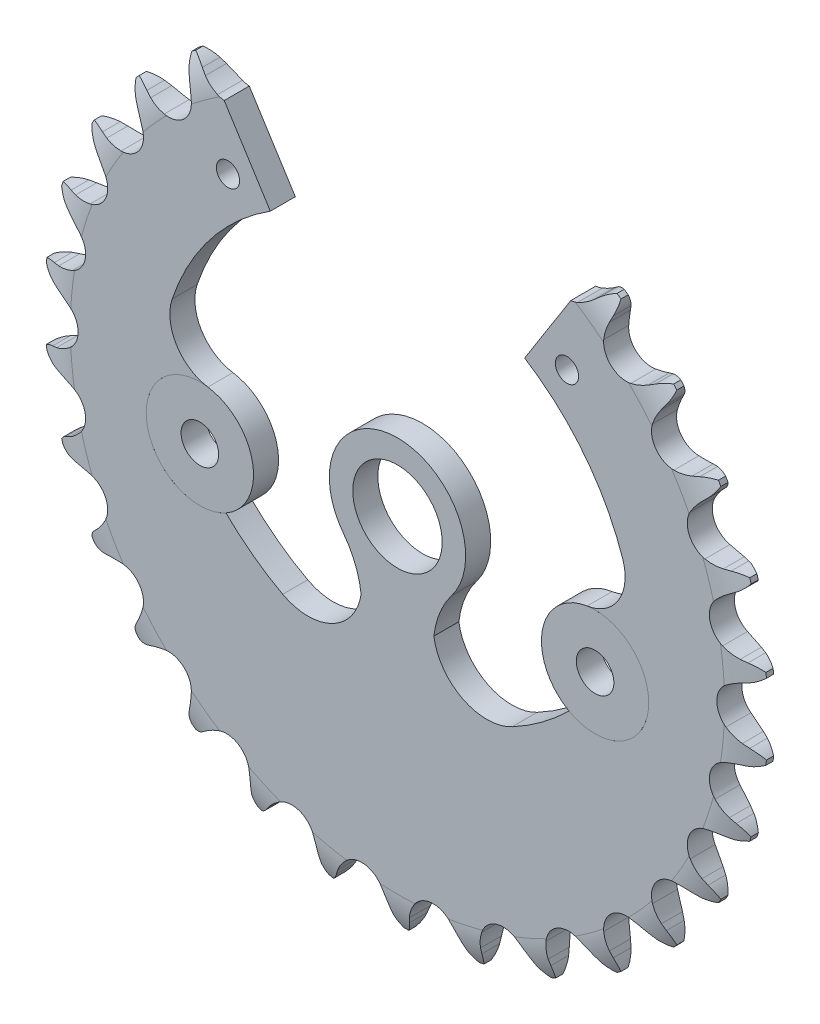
from build123d import *
from build123d.topology import SkipClean

# Parameters (mm, degrees)
CUT_EXTRUDE1_DEPTH      = 58.232611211
CIRPATTERN1_COUNT       = 30
BOSS_EXTRUDE1_START     = 1.4
SKETCH2_R               = 20
BOSS_EXTRUDE1_DEPTH     = 13.2
CUT_EXTRUDE2_DEPTH      = 59.916091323
CUT_EXTRUDE2_DEPTH_BACK = 59.916091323
SKETCH3_R               = 5
SKETCH4_W               = 2.1
SKETCH4_H               = 7.490368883
CUT_EXTRUDE4_START      = -13.2
SKETCH6_R               = 20
CUT_EXTRUDE4_DEPTH      = 13.2
SKETCH8_R               = 6
BOSS_EXTRUDE3_DEPTH     = 0.0001
CUT_EXTRUDE5_DEPTH      = 58.147054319
M5X0_8_TAPPED_HOLE3_D   = 4.2
CUT_EXTRUDE7_DEPTH      = 58.147059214
M2_TAPPED_HOLE1_D       = 2.6


with BuildPart() as part:
    # Sketch1 → Revolve1 (revolve)
    with BuildSketch(Plane(origin=(0, 0, 0), x_dir=(0, 0, -1), z_dir=(1, 0, 0))):
        with BuildLine():
            Line((1.4, 0), (-1.4, 0))
            Line((-1.4, 0), (-1.4, 36.584474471))
            ThreePointArc((-1.4, 36.584474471), (-1.145966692, 38.584474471), (-0.4, 40.457457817))
            Line((-0.4, 40.457457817), (0.4, 40.457457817))
            ThreePointArc((0.4, 40.457457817), (1.145966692, 38.584474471), (1.4, 36.584474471))
            Line((1.4, 36.584474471), (1.4, 0))
        make_face()
    revolve(axis=Axis((0, 0, -1.4), (0, 0, 1)))

    # Sketch0 → Cut-Extrude1 (cut, symmetric)
    with BuildSketch(Plane.XY):
        with BuildLine():
            Line((7.22745346, -38.435746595), (6.918117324, -37.825131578))
            ThreePointArc((6.918117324, -37.825131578), (6.444890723, -37.034427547), (5.865390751, -36.3179528))
            ThreePointArc((5.865390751, -36.3179528), (3.733389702, -35.520830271), (1.813709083, -36.743801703))
            ThreePointArc((1.813709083, -36.743801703), (1.395836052, -37.565104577), (1.0973472, -38.436919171))
            Line((1.0973472, -38.436919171), (0.921724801, -39.098505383))
            ThreePointArc((0.921724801, -39.098505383), (-0.654559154, -41.368441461), (-3.318860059, -42.102458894))
            ThreePointArc((-3.318860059, -42.102458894), (4.414557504, -42.001709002), (11.99992842, -40.492389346))
            ThreePointArc((11.99992842, -40.492389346), (9.241238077, -40.32835126), (7.22745346, -38.435746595))
        make_face()
    cut_extrude1 = extrude(amount=CUT_EXTRUDE1_DEPTH, both=True, mode=Mode.SUBTRACT)

    # CirPattern1: Cut-Extrude1 ×30 about axis
    cirpattern1_axis = Axis((0, 0, 0), (0, 0, 1))
    for i in range(1, CIRPATTERN1_COUNT):
        add(cut_extrude1.rotate(cirpattern1_axis, i * 360 / CIRPATTERN1_COUNT), mode=Mode.SUBTRACT)

    # Sketch2 → Boss-Extrude1 (add)
    with BuildSketch(Plane.XY.offset(BOSS_EXTRUDE1_START)):
        with Locations(Location((0, 0, 0), (0, 0, 180))):
            Circle(SKETCH2_R)
    extrude(amount=BOSS_EXTRUDE1_DEPTH)

    # Sketch3 → Cut-Extrude2 (cut, two sides: drawn at the far end of the back side and taken through both)
    with BuildSketch(Plane.XY.offset(-CUT_EXTRUDE2_DEPTH_BACK)):
        Circle(SKETCH3_R)
    extrude(amount=CUT_EXTRUDE2_DEPTH + CUT_EXTRUDE2_DEPTH_BACK, mode=Mode.SUBTRACT)

    # Sketch4 → Cut-Revolve1 (revolve, cut)
    with BuildSketch(Plane(origin=(0, 0, 0), x_dir=(0, 0, -1), z_dir=(1, 0, 0)), mode=Mode.PRIVATE) as cut_revolve1_sk:
        Polygon((-14.6, 20), (-14.6, 19.5), (-14.1, 20), align=None)
        with Locations((-2.45, 36.712273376)):
            Rectangle(SKETCH4_W, SKETCH4_H)
    revolve(cut_revolve1_sk.sketch.rotate(Axis((0, 0, -1.4), (0, 0, 1)), 90), axis=Axis((0, 0, -1.4), (0, 0, 1)), mode=Mode.SUBTRACT)

    # Sketch6 → Cut-Extrude4 (cut)
    with BuildSketch(Plane.XY.offset(14.6).offset(CUT_EXTRUDE4_START)):
        Circle(SKETCH6_R)
    extrude(amount=CUT_EXTRUDE4_DEPTH, mode=Mode.SUBTRACT)

    # Sketch8 → Boss-Extrude3 (add)
    with BuildSketch(Plane.XY.offset(1.4)):
        with Locations((22.100856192, -4.000469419)):
            Circle(SKETCH8_R)
        with Locations(Location((-22.100856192, -4.000469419, 0), (0, 0, 180))):
            Circle(SKETCH8_R)
    extrude(amount=BOSS_EXTRUDE3_DEPTH)

    # Sketch9 → Cut-Extrude5 (cut, through all)
    with SkipClean():  # the faces are left unmerged after this step: merging them gives an invalid solid
        with BuildSketch(Plane.XY.offset(1.4)):
            with BuildLine():
                ThreePointArc((-12.834023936, -13.949278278), (-7.310717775, -14.02432971), (-4.066768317, -9.553386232))
                ThreePointArc((-4.066768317, -9.553386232), (-4.729241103, -6.958299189), (-6.056737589, -4.63212206))
                ThreePointArc((-6.056737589, -4.63212206), (0, 7.625), (6.056737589, -4.63212206))
                ThreePointArc((6.056737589, -4.63212206), (4.729241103, -6.958299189), (4.066768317, -9.553386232))
                ThreePointArc((4.066768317, -9.553386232), (7.310717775, -14.02432971), (12.834023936, -13.949278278))
                ThreePointArc((12.834023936, -13.949278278), (16.180462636, -11.828255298), (19.182870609, -9.243117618))
                ThreePointArc((19.182870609, -9.243117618), (16.196798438, -2.931777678), (21.205745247, 1.93238625))
                ThreePointArc((21.205745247, 1.93238625), (24.726593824, 4.269780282), (25.199295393, 8.469344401))
                ThreePointArc((25.199295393, 8.469344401), (0, 26.584474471), (-25.199295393, 8.469344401))
                ThreePointArc((-25.199295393, 8.469344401), (-24.726593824, 4.269780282), (-21.205745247, 1.93238625))
                ThreePointArc((-21.205745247, 1.93238625), (-16.196798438, -2.931777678), (-19.182870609, -9.243117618))
                ThreePointArc((-19.182870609, -9.243117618), (-16.180462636, -11.828255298), (-12.834023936, -13.949278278))
            make_face()
        extrude(amount=-CUT_EXTRUDE5_DEPTH, mode=Mode.SUBTRACT)

    # M5x0.8 Tapped Hole3 (through all)
    with Locations(Plane(origin=(0, 0, -1.4), x_dir=(-1, 0, 0), z_dir=(0, 0, -1))):
        with Locations((-22.100856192, -4.000469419), (22.100856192, -4.000469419)):
            Hole(M5X0_8_TAPPED_HOLE3_D / 2)

    # Sketch21 → Cut-Extrude7 (cut, through all)
    with SkipClean():  # the faces are left unmerged after this step: merging them gives an invalid solid
        with BuildSketch(Plane(origin=(0, 0, -1.4), x_dir=(-1, 0, 0), z_dir=(0, 0, -1))):
            with BuildLine():
                ThreePointArc((-14.222301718, 22.460196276), (-7.404112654, 25.532594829), (0, 26.584474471))
                Line((0, 26.584474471), (0, 40.457457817))
                Line((0, 40.457457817), (-25.618572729, 40.457457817))
                Line((-25.618572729, 40.457457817), (-14.222301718, 22.460196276))
            make_face()
            with BuildLine():
                Line((0, 40.457457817), (0, 26.584474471))
                ThreePointArc((0, 26.584474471), (7.404112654, 25.532594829), (14.222301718, 22.460196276))
                Line((14.222301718, 22.460196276), (25.618572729, 40.457457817))
                Line((25.618572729, 40.457457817), (0, 40.457457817))
            make_face()
        extrude(amount=-CUT_EXTRUDE7_DEPTH, mode=Mode.SUBTRACT)

    # M2 Tapped Hole1 (through all)
    with Locations(Plane(origin=(18.9546108, 23.68339229, -1.4), x_dir=(0, -1, 0), z_dir=(0, 0, -1))):
        with Locations((0, 0), (0, 37.90922161)):
            Hole(M2_TAPPED_HOLE1_D / 2)


solid = part.part
